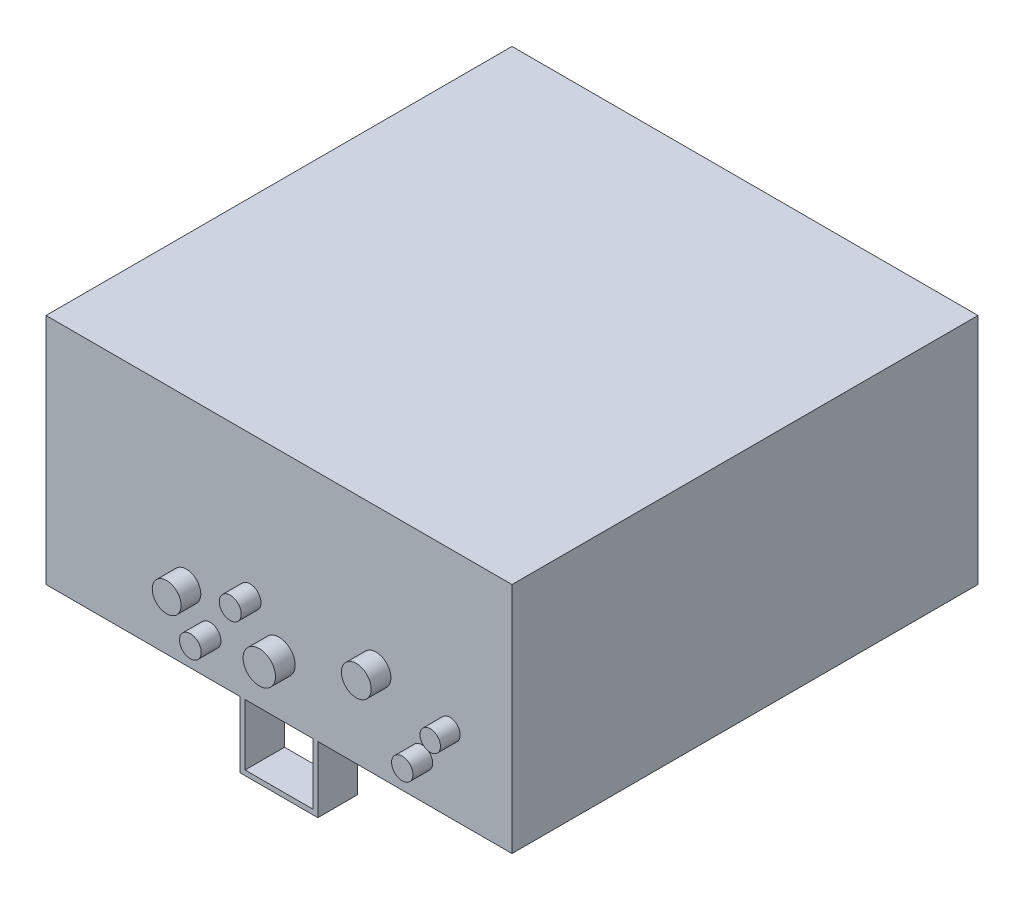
ISO-10303-21;
HEADER;
FILE_DESCRIPTION(('STEP AP214'),'2;1');
FILE_NAME('part.step','',(''),(''),'','','');
FILE_SCHEMA(('AUTOMOTIVE_DESIGN { 1 0 10303 214 1 1 1 1 }'));
ENDSEC;
DATA;
#1=APPLICATION_CONTEXT('core data for automotive mechanical design processes');
#2=APPLICATION_PROTOCOL_DEFINITION('international standard','automotive_design',2000,#1);
#3=PRODUCT_CONTEXT('',#1,'mechanical');
#4=PRODUCT('Part','Part','',(#3));
#5=PRODUCT_RELATED_PRODUCT_CATEGORY('part','',(#4));
#6=PRODUCT_DEFINITION_FORMATION('','',#4);
#7=PRODUCT_DEFINITION_CONTEXT('part definition',#1,'design');
#8=PRODUCT_DEFINITION('design','',#6,#7);
#9=PRODUCT_DEFINITION_SHAPE('','',#8);
#10=(LENGTH_UNIT() NAMED_UNIT(*) SI_UNIT(.MILLI.,.METRE.));
#11=(NAMED_UNIT(*) PLANE_ANGLE_UNIT() SI_UNIT($,.RADIAN.));
#12=(NAMED_UNIT(*) SI_UNIT($,.STERADIAN.) SOLID_ANGLE_UNIT());
#13=UNCERTAINTY_MEASURE_WITH_UNIT(LENGTH_MEASURE(1.E-05),#10,'distance_accuracy_value','');
#14=(GEOMETRIC_REPRESENTATION_CONTEXT(3) GLOBAL_UNCERTAINTY_ASSIGNED_CONTEXT((#13)) GLOBAL_UNIT_ASSIGNED_CONTEXT((#10,
#11,#12)) REPRESENTATION_CONTEXT('',''));
#15=CARTESIAN_POINT('',(0.,0.,0.));
#16=DIRECTION('',(0.,0.,1.));
#17=DIRECTION('',(1.,0.,0.));
#18=AXIS2_PLACEMENT_3D('',#15,#16,#17);
#19=CARTESIAN_POINT('',(0.,0.,0.));
#20=DIRECTION('',(0.,1.,0.));
#21=DIRECTION('',(0.,0.,1.));
#22=AXIS2_PLACEMENT_3D('',#19,#20,#21);
#23=PLANE('',#22);
#24=DIRECTION('',(0.,0.,-1.));
#25=VECTOR('',#24,1.);
#26=CARTESIAN_POINT('',(-49.999999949,0.,-249.199999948));
#27=LINE('',#26,#25);
#28=CARTESIAN_POINT('',(-49.999999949,0.,-249.199999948));
#29=VERTEX_POINT('',#28);
#30=CARTESIAN_POINT('',(-49.999999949,0.,-299.999999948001));
#31=VERTEX_POINT('',#30);
#32=EDGE_CURVE('E54',#29,#31,#27,.T.);
#33=ORIENTED_EDGE('',*,*,#32,.F.);
#34=DIRECTION('',(-1.,0.,0.));
#35=VECTOR('',#34,1.);
#36=CARTESIAN_POINT('',(-49.999999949,0.,-249.199999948));
#37=LINE('',#36,#35);
#38=CARTESIAN_POINT('',(-43.649999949,0.,-249.199999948));
#39=VERTEX_POINT('',#38);
#40=EDGE_CURVE('E49',#39,#29,#37,.T.);
#41=ORIENTED_EDGE('',*,*,#40,.F.);
#42=DIRECTION('',(0.,0.,-1.));
#43=VECTOR('',#42,1.);
#44=CARTESIAN_POINT('',(-43.649999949,0.,-249.199999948));
#45=LINE('',#44,#43);
#46=CARTESIAN_POINT('',(-43.649999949,0.,-299.999999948));
#47=VERTEX_POINT('',#46);
#48=EDGE_CURVE('E192',#39,#47,#45,.T.);
#49=ORIENTED_EDGE('',*,*,#48,.T.);
#50=DIRECTION('',(1.,0.,0.));
#51=VECTOR('',#50,1.);
#52=CARTESIAN_POINT('',(0.,0.,-299.999999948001));
#53=LINE('',#52,#51);
#54=CARTESIAN_POINT('',(43.649999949,0.,-299.999999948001));
#55=VERTEX_POINT('',#54);
#56=EDGE_CURVE('E313',#47,#55,#53,.T.);
#57=ORIENTED_EDGE('',*,*,#56,.T.);
#58=DIRECTION('',(0.,0.,-1.));
#59=VECTOR('',#58,1.);
#60=CARTESIAN_POINT('',(43.649999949,0.,-249.199999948));
#61=LINE('',#60,#59);
#62=CARTESIAN_POINT('',(43.649999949,0.,-249.199999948));
#63=VERTEX_POINT('',#62);
#64=EDGE_CURVE('E233',#63,#55,#61,.T.);
#65=ORIENTED_EDGE('',*,*,#64,.F.);
#66=DIRECTION('',(-1.,0.,0.));
#67=VECTOR('',#66,1.);
#68=CARTESIAN_POINT('',(43.649999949,0.,-249.199999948));
#69=LINE('',#68,#67);
#70=CARTESIAN_POINT('',(49.999999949,0.,-249.199999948));
#71=VERTEX_POINT('',#70);
#72=EDGE_CURVE('E201',#71,#63,#69,.T.);
#73=ORIENTED_EDGE('',*,*,#72,.F.);
#74=DIRECTION('',(0.,0.,-1.));
#75=VECTOR('',#74,1.);
#76=CARTESIAN_POINT('',(49.999999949,0.,-249.199999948));
#77=LINE('',#76,#75);
#78=CARTESIAN_POINT('',(49.999999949,0.,-299.999999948));
#79=VERTEX_POINT('',#78);
#80=EDGE_CURVE('E230',#71,#79,#77,.T.);
#81=ORIENTED_EDGE('',*,*,#80,.T.);
#82=CARTESIAN_POINT('',(299.999999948,0.,-299.999999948));
#83=VERTEX_POINT('',#82);
#84=EDGE_CURVE('E281',#79,#83,#53,.T.);
#85=ORIENTED_EDGE('',*,*,#84,.T.);
#86=DIRECTION('',(0.,0.,-1.));
#87=VECTOR('',#86,1.);
#88=CARTESIAN_POINT('',(299.999999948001,0.,0.));
#89=LINE('',#88,#87);
#90=CARTESIAN_POINT('',(299.999999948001,0.,299.999999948));
#91=VERTEX_POINT('',#90);
#92=EDGE_CURVE('E302',#91,#83,#89,.T.);
#93=ORIENTED_EDGE('',*,*,#92,.F.);
#94=DIRECTION('',(1.,0.,0.));
#95=VECTOR('',#94,1.);
#96=CARTESIAN_POINT('',(0.,0.,299.999999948));
#97=LINE('',#96,#95);
#98=CARTESIAN_POINT('',(49.999999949,0.,299.999999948));
#99=VERTEX_POINT('',#98);
#100=EDGE_CURVE('E316',#99,#91,#97,.T.);
#101=ORIENTED_EDGE('',*,*,#100,.F.);
#102=DIRECTION('',(0.,0.,1.));
#103=VECTOR('',#102,1.);
#104=CARTESIAN_POINT('',(49.999999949,0.,249.199999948));
#105=LINE('',#104,#103);
#106=CARTESIAN_POINT('',(49.999999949,0.,249.199999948));
#107=VERTEX_POINT('',#106);
#108=EDGE_CURVE('E289',#107,#99,#105,.T.);
#109=ORIENTED_EDGE('',*,*,#108,.F.);
#110=DIRECTION('',(-1.,0.,0.));
#111=VECTOR('',#110,1.);
#112=CARTESIAN_POINT('',(43.649999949,0.,249.199999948));
#113=LINE('',#112,#111);
#114=CARTESIAN_POINT('',(43.649999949,0.,249.199999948));
#115=VERTEX_POINT('',#114);
#116=EDGE_CURVE('E251',#107,#115,#113,.T.);
#117=ORIENTED_EDGE('',*,*,#116,.T.);
#118=DIRECTION('',(0.,0.,1.));
#119=VECTOR('',#118,1.);
#120=CARTESIAN_POINT('',(43.649999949,0.,249.199999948));
#121=LINE('',#120,#119);
#122=CARTESIAN_POINT('',(43.649999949,0.,299.999999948));
#123=VERTEX_POINT('',#122);
#124=EDGE_CURVE('E286',#115,#123,#121,.T.);
#125=ORIENTED_EDGE('',*,*,#124,.T.);
#126=CARTESIAN_POINT('',(-43.649999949,0.,299.999999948));
#127=VERTEX_POINT('',#126);
#128=EDGE_CURVE('E320',#127,#123,#97,.T.);
#129=ORIENTED_EDGE('',*,*,#128,.F.);
#130=DIRECTION('',(0.,0.,1.));
#131=VECTOR('',#130,1.);
#132=CARTESIAN_POINT('',(-43.649999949,0.,249.199999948));
#133=LINE('',#132,#131);
#134=CARTESIAN_POINT('',(-43.649999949,0.,249.199999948));
#135=VERTEX_POINT('',#134);
#136=EDGE_CURVE('E278',#135,#127,#133,.T.);
#137=ORIENTED_EDGE('',*,*,#136,.F.);
#138=DIRECTION('',(-1.,0.,0.));
#139=VECTOR('',#138,1.);
#140=CARTESIAN_POINT('',(-49.999999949,0.,249.199999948));
#141=LINE('',#140,#139);
#142=CARTESIAN_POINT('',(-49.999999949,0.,249.199999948));
#143=VERTEX_POINT('',#142);
#144=EDGE_CURVE('E238',#135,#143,#141,.T.);
#145=ORIENTED_EDGE('',*,*,#144,.T.);
#146=DIRECTION('',(0.,0.,1.));
#147=VECTOR('',#146,1.);
#148=CARTESIAN_POINT('',(-49.999999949,0.,249.199999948));
#149=LINE('',#148,#147);
#150=CARTESIAN_POINT('',(-49.999999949,0.,299.999999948));
#151=VERTEX_POINT('',#150);
#152=EDGE_CURVE('E263',#143,#151,#149,.T.);
#153=ORIENTED_EDGE('',*,*,#152,.T.);
#154=CARTESIAN_POINT('',(-299.999999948,0.,299.999999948));
#155=VERTEX_POINT('',#154);
#156=EDGE_CURVE('E317',#155,#151,#97,.T.);
#157=ORIENTED_EDGE('',*,*,#156,.F.);
#158=DIRECTION('',(0.,0.,-1.));
#159=VECTOR('',#158,1.);
#160=CARTESIAN_POINT('',(-299.999999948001,0.,0.));
#161=LINE('',#160,#159);
#162=CARTESIAN_POINT('',(-299.999999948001,0.,-299.999999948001));
#163=VERTEX_POINT('',#162);
#164=EDGE_CURVE('E312',#155,#163,#161,.T.);
#165=ORIENTED_EDGE('',*,*,#164,.T.);
#166=EDGE_CURVE('E310',#163,#31,#53,.T.);
#167=ORIENTED_EDGE('',*,*,#166,.T.);
#168=EDGE_LOOP('',(#33,#41,#49,#57,#65,#73,#81,#85,#93,#101,#109,#117,#125,#129,#137,#145,#153,
#157,#165,#167));
#169=FACE_BOUND('',#168,.T.);
#170=ADVANCED_FACE('F34',(#169),#23,.F.);
#171=CARTESIAN_POINT('',(0.,300.,-299.999999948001));
#172=DIRECTION('',(0.,0.,-1.));
#173=DIRECTION('',(-1.,0.,0.));
#174=AXIS2_PLACEMENT_3D('',#171,#172,#173);
#175=PLANE('',#174);
#176=DIRECTION('',(0.,-1.,0.));
#177=VECTOR('',#176,1.);
#178=CARTESIAN_POINT('',(-49.999999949,0.,-299.999999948));
#179=LINE('',#178,#177);
#180=CARTESIAN_POINT('',(-49.999999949,-85.,-299.999999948));
#181=VERTEX_POINT('',#180);
#182=EDGE_CURVE('E196',#31,#181,#179,.T.);
#183=ORIENTED_EDGE('',*,*,#182,.F.);
#184=ORIENTED_EDGE('',*,*,#166,.F.);
#185=DIRECTION('',(0.,-1.,0.));
#186=VECTOR('',#185,1.);
#187=CARTESIAN_POINT('',(-299.999999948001,300.,-299.999999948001));
#188=LINE('',#187,#186);
#189=CARTESIAN_POINT('',(-299.999999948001,300.,-299.999999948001));
#190=VERTEX_POINT('',#189);
#191=EDGE_CURVE('E330',#190,#163,#188,.T.);
#192=ORIENTED_EDGE('',*,*,#191,.F.);
#193=DIRECTION('',(1.,0.,0.));
#194=VECTOR('',#193,1.);
#195=CARTESIAN_POINT('',(0.,300.,-299.999999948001));
#196=LINE('',#195,#194);
#197=CARTESIAN_POINT('',(299.999999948,300.,-299.999999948));
#198=VERTEX_POINT('',#197);
#199=EDGE_CURVE('E298',#190,#198,#196,.T.);
#200=ORIENTED_EDGE('',*,*,#199,.T.);
#201=DIRECTION('',(0.,-1.,0.));
#202=VECTOR('',#201,1.);
#203=CARTESIAN_POINT('',(299.999999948,300.,-299.999999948));
#204=LINE('',#203,#202);
#205=EDGE_CURVE('E309',#198,#83,#204,.T.);
#206=ORIENTED_EDGE('',*,*,#205,.T.);
#207=ORIENTED_EDGE('',*,*,#84,.F.);
#208=DIRECTION('',(0.,1.,0.));
#209=VECTOR('',#208,1.);
#210=CARTESIAN_POINT('',(49.999999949,-85.,-299.999999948));
#211=LINE('',#210,#209);
#212=CARTESIAN_POINT('',(49.999999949,-85.,-299.999999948));
#213=VERTEX_POINT('',#212);
#214=EDGE_CURVE('E216',#213,#79,#211,.T.);
#215=ORIENTED_EDGE('',*,*,#214,.F.);
#216=DIRECTION('',(1.,0.,0.));
#217=VECTOR('',#216,1.);
#218=CARTESIAN_POINT('',(-49.999999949,-85.,-299.999999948));
#219=LINE('',#218,#217);
#220=EDGE_CURVE('E219',#181,#213,#219,.T.);
#221=ORIENTED_EDGE('',*,*,#220,.F.);
#222=EDGE_LOOP('',(#183,#184,#192,#200,#206,#207,#215,#221));
#223=FACE_BOUND('',#222,.T.);
#224=ORIENTED_EDGE('',*,*,#56,.F.);
#225=DIRECTION('',(0.,1.,0.));
#226=VECTOR('',#225,1.);
#227=CARTESIAN_POINT('',(-43.649999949,0.,-299.999999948));
#228=LINE('',#227,#226);
#229=CARTESIAN_POINT('',(-43.649999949,-78.65,-299.999999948));
#230=VERTEX_POINT('',#229);
#231=EDGE_CURVE('E210',#230,#47,#228,.T.);
#232=ORIENTED_EDGE('',*,*,#231,.F.);
#233=DIRECTION('',(-1.,0.,0.));
#234=VECTOR('',#233,1.);
#235=CARTESIAN_POINT('',(-43.649999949,-78.65,-299.999999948));
#236=LINE('',#235,#234);
#237=CARTESIAN_POINT('',(43.649999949,-78.65,-299.999999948));
#238=VERTEX_POINT('',#237);
#239=EDGE_CURVE('E187',#238,#230,#236,.T.);
#240=ORIENTED_EDGE('',*,*,#239,.F.);
#241=DIRECTION('',(0.,-1.,0.));
#242=VECTOR('',#241,1.);
#243=CARTESIAN_POINT('',(43.649999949,-78.65,-299.999999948));
#244=LINE('',#243,#242);
#245=EDGE_CURVE('E214',#55,#238,#244,.T.);
#246=ORIENTED_EDGE('',*,*,#245,.F.);
#247=EDGE_LOOP('',(#224,#232,#240,#246));
#248=FACE_BOUND('',#247,.T.);
#249=ADVANCED_FACE('F36',(#223,#248),#175,.T.);
#250=CARTESIAN_POINT('',(-299.999999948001,300.,0.));
#251=DIRECTION('',(-1.,0.,0.));
#252=DIRECTION('',(0.,0.,1.));
#253=AXIS2_PLACEMENT_3D('',#250,#251,#252);
#254=PLANE('',#253);
#255=ORIENTED_EDGE('',*,*,#164,.F.);
#256=DIRECTION('',(0.,-1.,0.));
#257=VECTOR('',#256,1.);
#258=CARTESIAN_POINT('',(-299.999999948,300.,299.999999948));
#259=LINE('',#258,#257);
#260=CARTESIAN_POINT('',(-299.999999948,300.,299.999999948));
#261=VERTEX_POINT('',#260);
#262=EDGE_CURVE('E328',#261,#155,#259,.T.);
#263=ORIENTED_EDGE('',*,*,#262,.F.);
#264=DIRECTION('',(0.,0.,-1.));
#265=VECTOR('',#264,1.);
#266=CARTESIAN_POINT('',(-299.999999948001,300.,0.));
#267=LINE('',#266,#265);
#268=EDGE_CURVE('E301',#261,#190,#267,.T.);
#269=ORIENTED_EDGE('',*,*,#268,.T.);
#270=ORIENTED_EDGE('',*,*,#191,.T.);
#271=EDGE_LOOP('',(#255,#263,#269,#270));
#272=FACE_BOUND('',#271,.T.);
#273=ADVANCED_FACE('F355',(#272),#254,.T.);
#274=CARTESIAN_POINT('',(0.,300.,299.999999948));
#275=DIRECTION('',(0.,0.,-1.));
#276=DIRECTION('',(-1.,0.,0.));
#277=AXIS2_PLACEMENT_3D('',#274,#275,#276);
#278=PLANE('',#277);
#279=CARTESIAN_POINT('',(-88.7391239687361,49.5940995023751,299.999999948));
#280=DIRECTION('',(0.,0.,-1.));
#281=DIRECTION('',(-1.,0.,0.));
#282=AXIS2_PLACEMENT_3D('',#279,#280,#281);
#283=CIRCLE('',#282,13.9939986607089);
#284=CARTESIAN_POINT('',(-102.733122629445,49.5940995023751,299.999999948));
#285=VERTEX_POINT('',#284);
#286=EDGE_CURVE('E11',#285,#285,#283,.F.);
#287=ORIENTED_EDGE('',*,*,#286,.F.);
#288=EDGE_LOOP('',(#287));
#289=FACE_BOUND('',#288,.T.);
#290=CARTESIAN_POINT('',(-37.3572852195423,117.996386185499,299.999999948));
#291=DIRECTION('',(0.,0.,-1.));
#292=DIRECTION('',(-1.,0.,0.));
#293=AXIS2_PLACEMENT_3D('',#290,#291,#292);
#294=CIRCLE('',#293,14.1519380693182);
#295=CARTESIAN_POINT('',(-51.5092232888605,117.996386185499,299.999999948));
#296=VERTEX_POINT('',#295);
#297=EDGE_CURVE('E42',#296,#296,#294,.F.);
#298=ORIENTED_EDGE('',*,*,#297,.F.);
#299=EDGE_LOOP('',(#298));
#300=FACE_BOUND('',#299,.T.);
#301=CARTESIAN_POINT('',(220.06952649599,98.8112566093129,299.999999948));
#302=DIRECTION('',(0.,0.,-1.));
#303=DIRECTION('',(-1.,0.,0.));
#304=AXIS2_PLACEMENT_3D('',#301,#302,#303);
#305=CIRCLE('',#304,13.2139376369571);
#306=CARTESIAN_POINT('',(206.855588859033,98.8112566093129,299.999999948));
#307=VERTEX_POINT('',#306);
#308=EDGE_CURVE('E344',#307,#307,#305,.F.);
#309=ORIENTED_EDGE('',*,*,#308,.F.);
#310=EDGE_LOOP('',(#309));
#311=FACE_BOUND('',#310,.T.);
#312=CARTESIAN_POINT('',(184.082271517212,49.5940995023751,299.999999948));
#313=DIRECTION('',(0.,0.,-1.));
#314=DIRECTION('',(-1.,0.,0.));
#315=AXIS2_PLACEMENT_3D('',#312,#313,#314);
#316=CIRCLE('',#315,13.7633808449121);
#317=CARTESIAN_POINT('',(170.3188906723,49.5940995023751,299.999999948));
#318=VERTEX_POINT('',#317);
#319=EDGE_CURVE('E341',#318,#318,#316,.F.);
#320=ORIENTED_EDGE('',*,*,#319,.F.);
#321=EDGE_LOOP('',(#320));
#322=FACE_BOUND('',#321,.T.);
#323=CARTESIAN_POINT('',(124.92661913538,117.996386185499,299.999999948));
#324=DIRECTION('',(0.,0.,-1.));
#325=DIRECTION('',(-1.,0.,0.));
#326=AXIS2_PLACEMENT_3D('',#323,#324,#325);
#327=CIRCLE('',#326,19.1851295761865);
#328=CARTESIAN_POINT('',(105.741489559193,117.996386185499,299.999999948));
#329=VERTEX_POINT('',#328);
#330=EDGE_CURVE('E338',#329,#329,#327,.F.);
#331=ORIENTED_EDGE('',*,*,#330,.F.);
#332=EDGE_LOOP('',(#331));
#333=FACE_BOUND('',#332,.T.);
#334=CARTESIAN_POINT('',(0.,70.4448302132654,299.999999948));
#335=DIRECTION('',(0.,0.,-1.));
#336=DIRECTION('',(-1.,0.,0.));
#337=AXIS2_PLACEMENT_3D('',#334,#335,#336);
#338=CIRCLE('',#337,20.8507307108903);
#339=CARTESIAN_POINT('',(-20.8507307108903,70.4448302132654,299.999999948));
#340=VERTEX_POINT('',#339);
#341=EDGE_CURVE('E335',#340,#340,#338,.F.);
#342=ORIENTED_EDGE('',*,*,#341,.F.);
#343=EDGE_LOOP('',(#342));
#344=FACE_BOUND('',#343,.T.);
#345=CARTESIAN_POINT('',(-119.268064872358,88.9982021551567,299.999999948));
#346=DIRECTION('',(0.,0.,-1.));
#347=DIRECTION('',(-1.,0.,0.));
#348=AXIS2_PLACEMENT_3D('',#345,#346,#347);
#349=CIRCLE('',#348,18.5533719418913);
#350=CARTESIAN_POINT('',(-137.821436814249,88.9982021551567,299.999999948));
#351=VERTEX_POINT('',#350);
#352=EDGE_CURVE('E332',#351,#351,#349,.F.);
#353=ORIENTED_EDGE('',*,*,#352,.F.);
#354=EDGE_LOOP('',(#353));
#355=FACE_BOUND('',#354,.T.);
#356=ORIENTED_EDGE('',*,*,#128,.T.);
#357=DIRECTION('',(0.,-1.,0.));
#358=VECTOR('',#357,1.);
#359=CARTESIAN_POINT('',(43.649999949,-78.65,299.999999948));
#360=LINE('',#359,#358);
#361=CARTESIAN_POINT('',(43.649999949,-78.65,299.999999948));
#362=VERTEX_POINT('',#361);
#363=EDGE_CURVE('E271',#123,#362,#360,.T.);
#364=ORIENTED_EDGE('',*,*,#363,.T.);
#365=DIRECTION('',(-1.,0.,0.));
#366=VECTOR('',#365,1.);
#367=CARTESIAN_POINT('',(-43.649999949,-78.65,299.999999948));
#368=LINE('',#367,#366);
#369=CARTESIAN_POINT('',(-43.649999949,-78.65,299.999999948));
#370=VERTEX_POINT('',#369);
#371=EDGE_CURVE('E274',#362,#370,#368,.T.);
#372=ORIENTED_EDGE('',*,*,#371,.T.);
#373=DIRECTION('',(0.,1.,0.));
#374=VECTOR('',#373,1.);
#375=CARTESIAN_POINT('',(-43.649999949,0.,299.999999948));
#376=LINE('',#375,#374);
#377=EDGE_CURVE('E242',#370,#127,#376,.T.);
#378=ORIENTED_EDGE('',*,*,#377,.T.);
#379=EDGE_LOOP('',(#356,#364,#372,#378));
#380=FACE_BOUND('',#379,.T.);
#381=ORIENTED_EDGE('',*,*,#156,.T.);
#382=DIRECTION('',(0.,-1.,0.));
#383=VECTOR('',#382,1.);
#384=CARTESIAN_POINT('',(-49.999999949,0.,299.999999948));
#385=LINE('',#384,#383);
#386=CARTESIAN_POINT('',(-49.999999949,-85.,299.999999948));
#387=VERTEX_POINT('',#386);
#388=EDGE_CURVE('E223',#151,#387,#385,.T.);
#389=ORIENTED_EDGE('',*,*,#388,.T.);
#390=DIRECTION('',(1.,0.,0.));
#391=VECTOR('',#390,1.);
#392=CARTESIAN_POINT('',(-49.999999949,-85.,299.999999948));
#393=LINE('',#392,#391);
#394=CARTESIAN_POINT('',(49.999999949,-85.,299.999999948));
#395=VERTEX_POINT('',#394);
#396=EDGE_CURVE('E266',#387,#395,#393,.T.);
#397=ORIENTED_EDGE('',*,*,#396,.T.);
#398=DIRECTION('',(0.,1.,0.));
#399=VECTOR('',#398,1.);
#400=CARTESIAN_POINT('',(49.999999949,-85.,299.999999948));
#401=LINE('',#400,#399);
#402=EDGE_CURVE('E269',#395,#99,#401,.T.);
#403=ORIENTED_EDGE('',*,*,#402,.T.);
#404=ORIENTED_EDGE('',*,*,#100,.T.);
#405=DIRECTION('',(0.,-1.,0.));
#406=VECTOR('',#405,1.);
#407=CARTESIAN_POINT('',(299.999999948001,300.,299.999999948));
#408=LINE('',#407,#406);
#409=CARTESIAN_POINT('',(299.999999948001,300.,299.999999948));
#410=VERTEX_POINT('',#409);
#411=EDGE_CURVE('E325',#410,#91,#408,.T.);
#412=ORIENTED_EDGE('',*,*,#411,.F.);
#413=DIRECTION('',(1.,0.,0.));
#414=VECTOR('',#413,1.);
#415=CARTESIAN_POINT('',(0.,300.,299.999999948));
#416=LINE('',#415,#414);
#417=EDGE_CURVE('E305',#261,#410,#416,.T.);
#418=ORIENTED_EDGE('',*,*,#417,.F.);
#419=ORIENTED_EDGE('',*,*,#262,.T.);
#420=EDGE_LOOP('',(#381,#389,#397,#403,#404,#412,#418,#419));
#421=FACE_BOUND('',#420,.T.);
#422=ADVANCED_FACE('F351',(#289,#300,#311,#322,#333,#344,#355,#380,#421),#278,.F.);
#423=CARTESIAN_POINT('',(299.999999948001,300.,0.));
#424=DIRECTION('',(-1.,0.,0.));
#425=DIRECTION('',(0.,0.,1.));
#426=AXIS2_PLACEMENT_3D('',#423,#424,#425);
#427=PLANE('',#426);
#428=ORIENTED_EDGE('',*,*,#92,.T.);
#429=ORIENTED_EDGE('',*,*,#205,.F.);
#430=DIRECTION('',(0.,0.,-1.));
#431=VECTOR('',#430,1.);
#432=CARTESIAN_POINT('',(299.999999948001,300.,0.));
#433=LINE('',#432,#431);
#434=EDGE_CURVE('E307',#410,#198,#433,.T.);
#435=ORIENTED_EDGE('',*,*,#434,.F.);
#436=ORIENTED_EDGE('',*,*,#411,.T.);
#437=EDGE_LOOP('',(#428,#429,#435,#436));
#438=FACE_BOUND('',#437,.T.);
#439=ADVANCED_FACE('F354',(#438),#427,.F.);
#440=CARTESIAN_POINT('',(0.,300.,0.));
#441=DIRECTION('',(0.,1.,0.));
#442=DIRECTION('',(0.,0.,1.));
#443=AXIS2_PLACEMENT_3D('',#440,#441,#442);
#444=PLANE('',#443);
#445=ORIENTED_EDGE('',*,*,#199,.F.);
#446=ORIENTED_EDGE('',*,*,#268,.F.);
#447=ORIENTED_EDGE('',*,*,#417,.T.);
#448=ORIENTED_EDGE('',*,*,#434,.T.);
#449=EDGE_LOOP('',(#445,#446,#447,#448));
#450=FACE_BOUND('',#449,.T.);
#451=ADVANCED_FACE('F408',(#450),#444,.T.);
#452=CARTESIAN_POINT('',(-43.649999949,0.,249.199999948));
#453=DIRECTION('',(1.,0.,0.));
#454=DIRECTION('',(0.,1.,0.));
#455=AXIS2_PLACEMENT_3D('',#452,#453,#454);
#456=PLANE('',#455);
#457=ORIENTED_EDGE('',*,*,#377,.F.);
#458=DIRECTION('',(0.,0.,1.));
#459=VECTOR('',#458,1.);
#460=CARTESIAN_POINT('',(-43.649999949,-78.65,249.199999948));
#461=LINE('',#460,#459);
#462=CARTESIAN_POINT('',(-43.649999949,-78.65,249.199999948));
#463=VERTEX_POINT('',#462);
#464=EDGE_CURVE('E282',#463,#370,#461,.T.);
#465=ORIENTED_EDGE('',*,*,#464,.F.);
#466=DIRECTION('',(0.,1.,0.));
#467=VECTOR('',#466,1.);
#468=CARTESIAN_POINT('',(-43.649999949,0.,249.199999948));
#469=LINE('',#468,#467);
#470=EDGE_CURVE('E260',#463,#135,#469,.T.);
#471=ORIENTED_EDGE('',*,*,#470,.T.);
#472=ORIENTED_EDGE('',*,*,#136,.T.);
#473=EDGE_LOOP('',(#457,#465,#471,#472));
#474=FACE_BOUND('',#473,.T.);
#475=ADVANCED_FACE('F415',(#474),#456,.T.);
#476=CARTESIAN_POINT('',(-43.649999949,-78.65,249.199999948));
#477=DIRECTION('',(0.,1.,0.));
#478=DIRECTION('',(0.,0.,1.));
#479=AXIS2_PLACEMENT_3D('',#476,#477,#478);
#480=PLANE('',#479);
#481=ORIENTED_EDGE('',*,*,#371,.F.);
#482=DIRECTION('',(0.,0.,1.));
#483=VECTOR('',#482,1.);
#484=CARTESIAN_POINT('',(43.649999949,-78.65,249.199999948));
#485=LINE('',#484,#483);
#486=CARTESIAN_POINT('',(43.649999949,-78.65,249.199999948));
#487=VERTEX_POINT('',#486);
#488=EDGE_CURVE('E284',#487,#362,#485,.T.);
#489=ORIENTED_EDGE('',*,*,#488,.F.);
#490=DIRECTION('',(-1.,0.,0.));
#491=VECTOR('',#490,1.);
#492=CARTESIAN_POINT('',(-43.649999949,-78.65,249.199999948));
#493=LINE('',#492,#491);
#494=EDGE_CURVE('E257',#487,#463,#493,.T.);
#495=ORIENTED_EDGE('',*,*,#494,.T.);
#496=ORIENTED_EDGE('',*,*,#464,.T.);
#497=EDGE_LOOP('',(#481,#489,#495,#496));
#498=FACE_BOUND('',#497,.T.);
#499=ADVANCED_FACE('F445',(#498),#480,.T.);
#500=CARTESIAN_POINT('',(43.649999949,-78.65,249.199999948));
#501=DIRECTION('',(-1.,0.,0.));
#502=DIRECTION('',(0.,-1.,0.));
#503=AXIS2_PLACEMENT_3D('',#500,#501,#502);
#504=PLANE('',#503);
#505=ORIENTED_EDGE('',*,*,#363,.F.);
#506=ORIENTED_EDGE('',*,*,#124,.F.);
#507=DIRECTION('',(0.,-1.,0.));
#508=VECTOR('',#507,1.);
#509=CARTESIAN_POINT('',(43.649999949,-78.65,249.199999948));
#510=LINE('',#509,#508);
#511=EDGE_CURVE('E254',#115,#487,#510,.T.);
#512=ORIENTED_EDGE('',*,*,#511,.T.);
#513=ORIENTED_EDGE('',*,*,#488,.T.);
#514=EDGE_LOOP('',(#505,#506,#512,#513));
#515=FACE_BOUND('',#514,.T.);
#516=ADVANCED_FACE('F443',(#515),#504,.T.);
#517=CARTESIAN_POINT('',(49.999999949,-85.,249.199999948));
#518=DIRECTION('',(1.,0.,0.));
#519=DIRECTION('',(0.,0.,-1.));
#520=AXIS2_PLACEMENT_3D('',#517,#518,#519);
#521=PLANE('',#520);
#522=ORIENTED_EDGE('',*,*,#402,.F.);
#523=DIRECTION('',(0.,0.,1.));
#524=VECTOR('',#523,1.);
#525=CARTESIAN_POINT('',(49.999999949,-85.,249.199999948));
#526=LINE('',#525,#524);
#527=CARTESIAN_POINT('',(49.999999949,-85.,249.199999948));
#528=VERTEX_POINT('',#527);
#529=EDGE_CURVE('E292',#528,#395,#526,.T.);
#530=ORIENTED_EDGE('',*,*,#529,.F.);
#531=DIRECTION('',(0.,1.,0.));
#532=VECTOR('',#531,1.);
#533=CARTESIAN_POINT('',(49.999999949,-85.,249.199999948));
#534=LINE('',#533,#532);
#535=EDGE_CURVE('E248',#528,#107,#534,.T.);
#536=ORIENTED_EDGE('',*,*,#535,.T.);
#537=ORIENTED_EDGE('',*,*,#108,.T.);
#538=EDGE_LOOP('',(#522,#530,#536,#537));
#539=FACE_BOUND('',#538,.T.);
#540=ADVANCED_FACE('F425',(#539),#521,.T.);
#541=CARTESIAN_POINT('',(-49.999999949,-85.,249.199999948));
#542=DIRECTION('',(0.,-1.,0.));
#543=DIRECTION('',(0.,0.,-1.));
#544=AXIS2_PLACEMENT_3D('',#541,#542,#543);
#545=PLANE('',#544);
#546=ORIENTED_EDGE('',*,*,#396,.F.);
#547=DIRECTION('',(0.,0.,1.));
#548=VECTOR('',#547,1.);
#549=CARTESIAN_POINT('',(-49.999999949,-85.,249.199999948));
#550=LINE('',#549,#548);
#551=CARTESIAN_POINT('',(-49.999999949,-85.,249.199999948));
#552=VERTEX_POINT('',#551);
#553=EDGE_CURVE('E294',#552,#387,#550,.T.);
#554=ORIENTED_EDGE('',*,*,#553,.F.);
#555=DIRECTION('',(1.,0.,0.));
#556=VECTOR('',#555,1.);
#557=CARTESIAN_POINT('',(-49.999999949,-85.,249.199999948));
#558=LINE('',#557,#556);
#559=EDGE_CURVE('E245',#552,#528,#558,.T.);
#560=ORIENTED_EDGE('',*,*,#559,.T.);
#561=ORIENTED_EDGE('',*,*,#529,.T.);
#562=EDGE_LOOP('',(#546,#554,#560,#561));
#563=FACE_BOUND('',#562,.T.);
#564=ADVANCED_FACE('F433',(#563),#545,.T.);
#565=CARTESIAN_POINT('',(-49.999999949,0.,249.199999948));
#566=DIRECTION('',(-1.,0.,0.));
#567=DIRECTION('',(0.,0.,1.));
#568=AXIS2_PLACEMENT_3D('',#565,#566,#567);
#569=PLANE('',#568);
#570=ORIENTED_EDGE('',*,*,#388,.F.);
#571=ORIENTED_EDGE('',*,*,#152,.F.);
#572=DIRECTION('',(0.,-1.,0.));
#573=VECTOR('',#572,1.);
#574=CARTESIAN_POINT('',(-49.999999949,0.,249.199999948));
#575=LINE('',#574,#573);
#576=EDGE_CURVE('E241',#143,#552,#575,.T.);
#577=ORIENTED_EDGE('',*,*,#576,.T.);
#578=ORIENTED_EDGE('',*,*,#553,.T.);
#579=EDGE_LOOP('',(#570,#571,#577,#578));
#580=FACE_BOUND('',#579,.T.);
#581=ADVANCED_FACE('F435',(#580),#569,.T.);
#582=CARTESIAN_POINT('',(0.,0.,249.199999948));
#583=DIRECTION('',(0.,0.,-1.));
#584=DIRECTION('',(-1.,0.,0.));
#585=AXIS2_PLACEMENT_3D('',#582,#583,#584);
#586=PLANE('',#585);
#587=ORIENTED_EDGE('',*,*,#144,.F.);
#588=ORIENTED_EDGE('',*,*,#470,.F.);
#589=ORIENTED_EDGE('',*,*,#494,.F.);
#590=ORIENTED_EDGE('',*,*,#511,.F.);
#591=ORIENTED_EDGE('',*,*,#116,.F.);
#592=ORIENTED_EDGE('',*,*,#535,.F.);
#593=ORIENTED_EDGE('',*,*,#559,.F.);
#594=ORIENTED_EDGE('',*,*,#576,.F.);
#595=EDGE_LOOP('',(#587,#588,#589,#590,#591,#592,#593,#594));
#596=FACE_BOUND('',#595,.T.);
#597=ADVANCED_FACE('F429',(#596),#586,.T.);
#598=CARTESIAN_POINT('',(-49.999999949,0.,-249.199999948));
#599=DIRECTION('',(1.,0.,0.));
#600=DIRECTION('',(0.,0.,-1.));
#601=AXIS2_PLACEMENT_3D('',#598,#599,#600);
#602=PLANE('',#601);
#603=ORIENTED_EDGE('',*,*,#182,.T.);
#604=DIRECTION('',(0.,0.,-1.));
#605=VECTOR('',#604,1.);
#606=CARTESIAN_POINT('',(-49.999999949,-85.,-249.199999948));
#607=LINE('',#606,#605);
#608=CARTESIAN_POINT('',(-49.999999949,-85.,-249.199999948));
#609=VERTEX_POINT('',#608);
#610=EDGE_CURVE('E224',#609,#181,#607,.T.);
#611=ORIENTED_EDGE('',*,*,#610,.F.);
#612=DIRECTION('',(0.,-1.,0.));
#613=VECTOR('',#612,1.);
#614=CARTESIAN_POINT('',(-49.999999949,0.,-249.199999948));
#615=LINE('',#614,#613);
#616=EDGE_CURVE('E208',#29,#609,#615,.T.);
#617=ORIENTED_EDGE('',*,*,#616,.F.);
#618=ORIENTED_EDGE('',*,*,#32,.T.);
#619=EDGE_LOOP('',(#603,#611,#617,#618));
#620=FACE_BOUND('',#619,.T.);
#621=ADVANCED_FACE('F385',(#620),#602,.F.);
#622=CARTESIAN_POINT('',(-49.999999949,-85.,-249.199999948));
#623=DIRECTION('',(0.,1.,0.));
#624=DIRECTION('',(0.,0.,1.));
#625=AXIS2_PLACEMENT_3D('',#622,#623,#624);
#626=PLANE('',#625);
#627=ORIENTED_EDGE('',*,*,#220,.T.);
#628=DIRECTION('',(0.,0.,-1.));
#629=VECTOR('',#628,1.);
#630=CARTESIAN_POINT('',(49.999999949,-85.,-249.199999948));
#631=LINE('',#630,#629);
#632=CARTESIAN_POINT('',(49.999999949,-85.,-249.199999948));
#633=VERTEX_POINT('',#632);
#634=EDGE_CURVE('E227',#633,#213,#631,.T.);
#635=ORIENTED_EDGE('',*,*,#634,.F.);
#636=DIRECTION('',(1.,0.,0.));
#637=VECTOR('',#636,1.);
#638=CARTESIAN_POINT('',(-49.999999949,-85.,-249.199999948));
#639=LINE('',#638,#637);
#640=EDGE_CURVE('E206',#609,#633,#639,.T.);
#641=ORIENTED_EDGE('',*,*,#640,.F.);
#642=ORIENTED_EDGE('',*,*,#610,.T.);
#643=EDGE_LOOP('',(#627,#635,#641,#642));
#644=FACE_BOUND('',#643,.T.);
#645=ADVANCED_FACE('F391',(#644),#626,.F.);
#646=CARTESIAN_POINT('',(49.999999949,-85.,-249.199999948));
#647=DIRECTION('',(-1.,0.,0.));
#648=DIRECTION('',(0.,0.,1.));
#649=AXIS2_PLACEMENT_3D('',#646,#647,#648);
#650=PLANE('',#649);
#651=ORIENTED_EDGE('',*,*,#214,.T.);
#652=ORIENTED_EDGE('',*,*,#80,.F.);
#653=DIRECTION('',(0.,1.,0.));
#654=VECTOR('',#653,1.);
#655=CARTESIAN_POINT('',(49.999999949,-85.,-249.199999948));
#656=LINE('',#655,#654);
#657=EDGE_CURVE('E203',#633,#71,#656,.T.);
#658=ORIENTED_EDGE('',*,*,#657,.F.);
#659=ORIENTED_EDGE('',*,*,#634,.T.);
#660=EDGE_LOOP('',(#651,#652,#658,#659));
#661=FACE_BOUND('',#660,.T.);
#662=ADVANCED_FACE('F393',(#661),#650,.F.);
#663=CARTESIAN_POINT('',(43.649999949,-78.65,-249.199999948));
#664=DIRECTION('',(1.,0.,0.));
#665=DIRECTION('',(0.,1.,0.));
#666=AXIS2_PLACEMENT_3D('',#663,#664,#665);
#667=PLANE('',#666);
#668=ORIENTED_EDGE('',*,*,#245,.T.);
#669=DIRECTION('',(0.,0.,-1.));
#670=VECTOR('',#669,1.);
#671=CARTESIAN_POINT('',(43.649999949,-78.65,-249.199999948));
#672=LINE('',#671,#670);
#673=CARTESIAN_POINT('',(43.649999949,-78.65,-249.199999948));
#674=VERTEX_POINT('',#673);
#675=EDGE_CURVE('E191',#674,#238,#672,.T.);
#676=ORIENTED_EDGE('',*,*,#675,.F.);
#677=DIRECTION('',(0.,-1.,0.));
#678=VECTOR('',#677,1.);
#679=CARTESIAN_POINT('',(43.649999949,-78.65,-249.199999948));
#680=LINE('',#679,#678);
#681=EDGE_CURVE('E178',#63,#674,#680,.T.);
#682=ORIENTED_EDGE('',*,*,#681,.F.);
#683=ORIENTED_EDGE('',*,*,#64,.T.);
#684=EDGE_LOOP('',(#668,#676,#682,#683));
#685=FACE_BOUND('',#684,.T.);
#686=ADVANCED_FACE('F396',(#685),#667,.F.);
#687=CARTESIAN_POINT('',(-43.649999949,-78.65,-249.199999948));
#688=DIRECTION('',(0.,-1.,0.));
#689=DIRECTION('',(0.,0.,-1.));
#690=AXIS2_PLACEMENT_3D('',#687,#688,#689);
#691=PLANE('',#690);
#692=ORIENTED_EDGE('',*,*,#239,.T.);
#693=DIRECTION('',(0.,0.,-1.));
#694=VECTOR('',#693,1.);
#695=CARTESIAN_POINT('',(-43.649999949,-78.65,-249.199999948));
#696=LINE('',#695,#694);
#697=CARTESIAN_POINT('',(-43.649999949,-78.65,-249.199999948));
#698=VERTEX_POINT('',#697);
#699=EDGE_CURVE('E184',#698,#230,#696,.T.);
#700=ORIENTED_EDGE('',*,*,#699,.F.);
#701=DIRECTION('',(-1.,0.,0.));
#702=VECTOR('',#701,1.);
#703=CARTESIAN_POINT('',(-43.649999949,-78.65,-249.199999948));
#704=LINE('',#703,#702);
#705=EDGE_CURVE('E170',#674,#698,#704,.T.);
#706=ORIENTED_EDGE('',*,*,#705,.F.);
#707=ORIENTED_EDGE('',*,*,#675,.T.);
#708=EDGE_LOOP('',(#692,#700,#706,#707));
#709=FACE_BOUND('',#708,.T.);
#710=ADVANCED_FACE('F185',(#709),#691,.F.);
#711=CARTESIAN_POINT('',(-43.649999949,0.,-249.199999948));
#712=DIRECTION('',(-1.,0.,0.));
#713=DIRECTION('',(0.,-1.,0.));
#714=AXIS2_PLACEMENT_3D('',#711,#712,#713);
#715=PLANE('',#714);
#716=ORIENTED_EDGE('',*,*,#231,.T.);
#717=ORIENTED_EDGE('',*,*,#48,.F.);
#718=DIRECTION('',(0.,1.,0.));
#719=VECTOR('',#718,1.);
#720=CARTESIAN_POINT('',(-43.649999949,0.,-249.199999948));
#721=LINE('',#720,#719);
#722=EDGE_CURVE('E174',#698,#39,#721,.T.);
#723=ORIENTED_EDGE('',*,*,#722,.F.);
#724=ORIENTED_EDGE('',*,*,#699,.T.);
#725=EDGE_LOOP('',(#716,#717,#723,#724));
#726=FACE_BOUND('',#725,.T.);
#727=ADVANCED_FACE('F194',(#726),#715,.F.);
#728=CARTESIAN_POINT('',(0.,0.,-249.199999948));
#729=DIRECTION('',(0.,0.,1.));
#730=DIRECTION('',(-1.,0.,0.));
#731=AXIS2_PLACEMENT_3D('',#728,#729,#730);
#732=PLANE('',#731);
#733=ORIENTED_EDGE('',*,*,#40,.T.);
#734=ORIENTED_EDGE('',*,*,#616,.T.);
#735=ORIENTED_EDGE('',*,*,#640,.T.);
#736=ORIENTED_EDGE('',*,*,#657,.T.);
#737=ORIENTED_EDGE('',*,*,#72,.T.);
#738=ORIENTED_EDGE('',*,*,#681,.T.);
#739=ORIENTED_EDGE('',*,*,#705,.T.);
#740=ORIENTED_EDGE('',*,*,#722,.T.);
#741=EDGE_LOOP('',(#733,#734,#735,#736,#737,#738,#739,#740));
#742=FACE_BOUND('',#741,.T.);
#743=ADVANCED_FACE('F172',(#742),#732,.T.);
#744=CARTESIAN_POINT('',(-119.268064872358,88.9982021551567,325.399999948));
#745=DIRECTION('',(0.,0.,-1.));
#746=DIRECTION('',(-1.,0.,0.));
#747=AXIS2_PLACEMENT_3D('',#744,#745,#746);
#748=CYLINDRICAL_SURFACE('',#747,18.5533719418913);
#749=CARTESIAN_POINT('',(-119.268064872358,88.9982021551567,325.399999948));
#750=DIRECTION('',(0.,0.,1.));
#751=DIRECTION('',(1.,0.,0.));
#752=AXIS2_PLACEMENT_3D('',#749,#750,#751);
#753=CIRCLE('',#752,18.5533719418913);
#754=CARTESIAN_POINT('',(-100.714692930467,88.9982021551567,325.399999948));
#755=VERTEX_POINT('',#754);
#756=EDGE_CURVE('E212',#755,#755,#753,.T.);
#757=ORIENTED_EDGE('',*,*,#756,.F.);
#758=EDGE_LOOP('',(#757));
#759=FACE_BOUND('',#758,.T.);
#760=ORIENTED_EDGE('',*,*,#352,.T.);
#761=EDGE_LOOP('',(#760));
#762=FACE_BOUND('',#761,.T.);
#763=ADVANCED_FACE('F480',(#759,#762),#748,.T.);
#764=CARTESIAN_POINT('',(-119.268064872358,88.9982021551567,325.399999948));
#765=DIRECTION('',(0.,0.,1.));
#766=DIRECTION('',(1.,0.,0.));
#767=AXIS2_PLACEMENT_3D('',#764,#765,#766);
#768=PLANE('',#767);
#769=ORIENTED_EDGE('',*,*,#756,.T.);
#770=EDGE_LOOP('',(#769));
#771=FACE_BOUND('',#770,.T.);
#772=ADVANCED_FACE('F483',(#771),#768,.T.);
#773=CARTESIAN_POINT('',(0.,70.4448302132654,325.399999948));
#774=DIRECTION('',(0.,0.,-1.));
#775=DIRECTION('',(-1.,0.,0.));
#776=AXIS2_PLACEMENT_3D('',#773,#774,#775);
#777=CYLINDRICAL_SURFACE('',#776,20.8507307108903);
#778=CARTESIAN_POINT('',(0.,70.4448302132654,325.399999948));
#779=DIRECTION('',(0.,0.,1.));
#780=DIRECTION('',(1.,0.,0.));
#781=AXIS2_PLACEMENT_3D('',#778,#779,#780);
#782=CIRCLE('',#781,20.8507307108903);
#783=CARTESIAN_POINT('',(20.8507307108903,70.4448302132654,325.399999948));
#784=VERTEX_POINT('',#783);
#785=EDGE_CURVE('E553',#784,#784,#782,.T.);
#786=ORIENTED_EDGE('',*,*,#785,.F.);
#787=EDGE_LOOP('',(#786));
#788=FACE_BOUND('',#787,.T.);
#789=ORIENTED_EDGE('',*,*,#341,.T.);
#790=EDGE_LOOP('',(#789));
#791=FACE_BOUND('',#790,.T.);
#792=ADVANCED_FACE('F487',(#788,#791),#777,.T.);
#793=CARTESIAN_POINT('',(0.,70.4448302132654,325.399999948));
#794=DIRECTION('',(0.,0.,1.));
#795=DIRECTION('',(1.,0.,0.));
#796=AXIS2_PLACEMENT_3D('',#793,#794,#795);
#797=PLANE('',#796);
#798=ORIENTED_EDGE('',*,*,#785,.T.);
#799=EDGE_LOOP('',(#798));
#800=FACE_BOUND('',#799,.T.);
#801=ADVANCED_FACE('F491',(#800),#797,.T.);
#802=CARTESIAN_POINT('',(124.92661913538,117.996386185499,325.399999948));
#803=DIRECTION('',(0.,0.,-1.));
#804=DIRECTION('',(-1.,0.,0.));
#805=AXIS2_PLACEMENT_3D('',#802,#803,#804);
#806=CYLINDRICAL_SURFACE('',#805,19.1851295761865);
#807=CARTESIAN_POINT('',(124.92661913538,117.996386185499,325.399999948));
#808=DIRECTION('',(0.,0.,1.));
#809=DIRECTION('',(1.,0.,0.));
#810=AXIS2_PLACEMENT_3D('',#807,#808,#809);
#811=CIRCLE('',#810,19.1851295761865);
#812=CARTESIAN_POINT('',(144.111748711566,117.996386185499,325.399999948));
#813=VERTEX_POINT('',#812);
#814=EDGE_CURVE('E550',#813,#813,#811,.T.);
#815=ORIENTED_EDGE('',*,*,#814,.F.);
#816=EDGE_LOOP('',(#815));
#817=FACE_BOUND('',#816,.T.);
#818=ORIENTED_EDGE('',*,*,#330,.T.);
#819=EDGE_LOOP('',(#818));
#820=FACE_BOUND('',#819,.T.);
#821=ADVANCED_FACE('F495',(#817,#820),#806,.T.);
#822=CARTESIAN_POINT('',(124.92661913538,117.996386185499,325.399999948));
#823=DIRECTION('',(0.,0.,1.));
#824=DIRECTION('',(1.,0.,0.));
#825=AXIS2_PLACEMENT_3D('',#822,#823,#824);
#826=PLANE('',#825);
#827=ORIENTED_EDGE('',*,*,#814,.T.);
#828=EDGE_LOOP('',(#827));
#829=FACE_BOUND('',#828,.T.);
#830=ADVANCED_FACE('F499',(#829),#826,.T.);
#831=CARTESIAN_POINT('',(184.082271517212,49.5940995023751,325.399999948));
#832=DIRECTION('',(0.,0.,-1.));
#833=DIRECTION('',(-1.,0.,0.));
#834=AXIS2_PLACEMENT_3D('',#831,#832,#833);
#835=CYLINDRICAL_SURFACE('',#834,13.7633808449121);
#836=CARTESIAN_POINT('',(184.082271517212,49.5940995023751,325.399999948));
#837=DIRECTION('',(0.,0.,1.));
#838=DIRECTION('',(1.,0.,0.));
#839=AXIS2_PLACEMENT_3D('',#836,#837,#838);
#840=CIRCLE('',#839,13.7633808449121);
#841=CARTESIAN_POINT('',(197.845652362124,49.5940995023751,325.399999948));
#842=VERTEX_POINT('',#841);
#843=EDGE_CURVE('E547',#842,#842,#840,.T.);
#844=ORIENTED_EDGE('',*,*,#843,.F.);
#845=EDGE_LOOP('',(#844));
#846=FACE_BOUND('',#845,.T.);
#847=ORIENTED_EDGE('',*,*,#319,.T.);
#848=EDGE_LOOP('',(#847));
#849=FACE_BOUND('',#848,.T.);
#850=ADVANCED_FACE('F503',(#846,#849),#835,.T.);
#851=CARTESIAN_POINT('',(184.082271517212,49.5940995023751,325.399999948));
#852=DIRECTION('',(0.,0.,1.));
#853=DIRECTION('',(1.,0.,0.));
#854=AXIS2_PLACEMENT_3D('',#851,#852,#853);
#855=PLANE('',#854);
#856=ORIENTED_EDGE('',*,*,#843,.T.);
#857=EDGE_LOOP('',(#856));
#858=FACE_BOUND('',#857,.T.);
#859=ADVANCED_FACE('F507',(#858),#855,.T.);
#860=CARTESIAN_POINT('',(220.06952649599,98.8112566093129,325.399999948));
#861=DIRECTION('',(0.,0.,-1.));
#862=DIRECTION('',(-1.,0.,0.));
#863=AXIS2_PLACEMENT_3D('',#860,#861,#862);
#864=CYLINDRICAL_SURFACE('',#863,13.2139376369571);
#865=CARTESIAN_POINT('',(220.06952649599,98.8112566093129,325.399999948));
#866=DIRECTION('',(0.,0.,1.));
#867=DIRECTION('',(1.,0.,0.));
#868=AXIS2_PLACEMENT_3D('',#865,#866,#867);
#869=CIRCLE('',#868,13.2139376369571);
#870=CARTESIAN_POINT('',(233.283464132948,98.8112566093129,325.399999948));
#871=VERTEX_POINT('',#870);
#872=EDGE_CURVE('E542',#871,#871,#869,.T.);
#873=ORIENTED_EDGE('',*,*,#872,.F.);
#874=EDGE_LOOP('',(#873));
#875=FACE_BOUND('',#874,.T.);
#876=ORIENTED_EDGE('',*,*,#308,.T.);
#877=EDGE_LOOP('',(#876));
#878=FACE_BOUND('',#877,.T.);
#879=ADVANCED_FACE('F511',(#875,#878),#864,.T.);
#880=CARTESIAN_POINT('',(220.06952649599,98.8112566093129,325.399999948));
#881=DIRECTION('',(0.,0.,1.));
#882=DIRECTION('',(1.,0.,0.));
#883=AXIS2_PLACEMENT_3D('',#880,#881,#882);
#884=PLANE('',#883);
#885=ORIENTED_EDGE('',*,*,#872,.T.);
#886=EDGE_LOOP('',(#885));
#887=FACE_BOUND('',#886,.T.);
#888=ADVANCED_FACE('F515',(#887),#884,.T.);
#889=CARTESIAN_POINT('',(-37.3572852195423,117.996386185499,325.399999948));
#890=DIRECTION('',(0.,0.,-1.));
#891=DIRECTION('',(-1.,0.,0.));
#892=AXIS2_PLACEMENT_3D('',#889,#890,#891);
#893=CYLINDRICAL_SURFACE('',#892,14.1519380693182);
#894=CARTESIAN_POINT('',(-37.3572852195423,117.996386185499,325.399999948));
#895=DIRECTION('',(0.,0.,1.));
#896=DIRECTION('',(1.,0.,0.));
#897=AXIS2_PLACEMENT_3D('',#894,#895,#896);
#898=CIRCLE('',#897,14.1519380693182);
#899=CARTESIAN_POINT('',(-23.205347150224,117.996386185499,325.399999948));
#900=VERTEX_POINT('',#899);
#901=EDGE_CURVE('E539',#900,#900,#898,.T.);
#902=ORIENTED_EDGE('',*,*,#901,.F.);
#903=EDGE_LOOP('',(#902));
#904=FACE_BOUND('',#903,.T.);
#905=ORIENTED_EDGE('',*,*,#297,.T.);
#906=EDGE_LOOP('',(#905));
#907=FACE_BOUND('',#906,.T.);
#908=ADVANCED_FACE('F349',(#904,#907),#893,.T.);
#909=CARTESIAN_POINT('',(-37.3572852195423,117.996386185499,325.399999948));
#910=DIRECTION('',(0.,0.,1.));
#911=DIRECTION('',(1.,0.,0.));
#912=AXIS2_PLACEMENT_3D('',#909,#910,#911);
#913=PLANE('',#912);
#914=ORIENTED_EDGE('',*,*,#901,.T.);
#915=EDGE_LOOP('',(#914));
#916=FACE_BOUND('',#915,.T.);
#917=ADVANCED_FACE('F522',(#916),#913,.T.);
#918=CARTESIAN_POINT('',(-88.7391239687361,49.5940995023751,325.399999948));
#919=DIRECTION('',(0.,0.,-1.));
#920=DIRECTION('',(-1.,0.,0.));
#921=AXIS2_PLACEMENT_3D('',#918,#919,#920);
#922=CYLINDRICAL_SURFACE('',#921,13.9939986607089);
#923=CARTESIAN_POINT('',(-88.7391239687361,49.5940995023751,325.399999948));
#924=DIRECTION('',(0.,0.,1.));
#925=DIRECTION('',(1.,0.,0.));
#926=AXIS2_PLACEMENT_3D('',#923,#924,#925);
#927=CIRCLE('',#926,13.9939986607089);
#928=CARTESIAN_POINT('',(-74.7451253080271,49.5940995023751,325.399999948));
#929=VERTEX_POINT('',#928);
#930=EDGE_CURVE('E538',#929,#929,#927,.T.);
#931=ORIENTED_EDGE('',*,*,#930,.F.);
#932=EDGE_LOOP('',(#931));
#933=FACE_BOUND('',#932,.T.);
#934=ORIENTED_EDGE('',*,*,#286,.T.);
#935=EDGE_LOOP('',(#934));
#936=FACE_BOUND('',#935,.T.);
#937=ADVANCED_FACE('F526',(#933,#936),#922,.T.);
#938=CARTESIAN_POINT('',(-88.7391239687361,49.5940995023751,325.399999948));
#939=DIRECTION('',(0.,0.,1.));
#940=DIRECTION('',(1.,0.,0.));
#941=AXIS2_PLACEMENT_3D('',#938,#939,#940);
#942=PLANE('',#941);
#943=ORIENTED_EDGE('',*,*,#930,.T.);
#944=EDGE_LOOP('',(#943));
#945=FACE_BOUND('',#944,.T.);
#946=ADVANCED_FACE('F530',(#945),#942,.T.);
#947=CLOSED_SHELL('',(#170,#249,#273,#422,#439,#451,#475,#499,#516,#540,#564,#581,#597,#621,
#645,#662,#686,#710,#727,#743,#763,#772,#792,#801,#821,#830,#850,#859,#879,#888,#908,#917,#937,#946));
#948=MANIFOLD_SOLID_BREP('B2',#947);
#949=ADVANCED_BREP_SHAPE_REPRESENTATION('',(#18,#948),#14);
#950=SHAPE_DEFINITION_REPRESENTATION(#9,#949);
ENDSEC;
END-ISO-10303-21;
